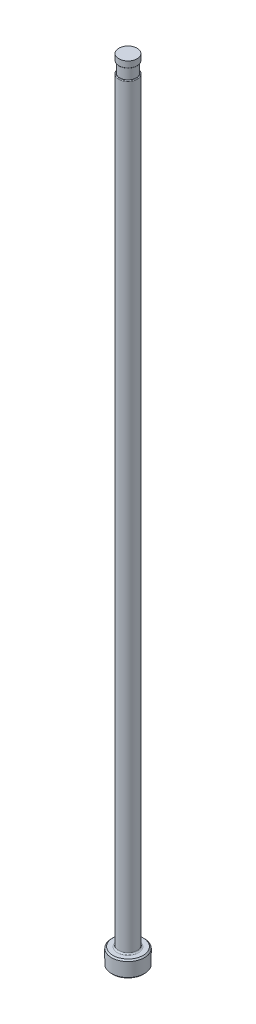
from build123d import *

# Parameters (mm, degrees)
CHAMFER1_SIZE     = 0.254
FILLET1_R         = 0.254
SKETCH2_W         = 0.2032
SKETCH2_H         = 2.032
D_SLOT_DEPTH      = 153.466131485
D_SLOT_DEPTH_BACK = 153.466131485
SKETCH5_W         = 0.01905
SKETCH5_H         = 1.27
FILLET2_R         = 0.127


with BuildPart() as part:
    # Sketch1 → Revolve1 (revolve)
    with BuildSketch(Plane.XY, mode=Mode.PRIVATE) as revolve1_sk:
        Polygon((0, 0), (-3.175, 0), (-3.175, 3.175), (-1.78562, 3.175), (-1.78562, 152.4), (0, 152.4), align=None)
    revolve(revolve1_sk.sketch.rotate(Axis((0, 259.958771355, 0), (0, -1, 0)), 270), axis=Axis((0, 259.958771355, 0), (0, -1, 0)))

    # Chamfer1
    chamfer1_edges = [part.edges().sort_by_distance(p)[0] for p in [
        (0, 3.175, -3.175),
        (0, 0, -3.175),
    ]]
    chamfer(chamfer1_edges, length=CHAMFER1_SIZE)

    # Fillet1
    fillet1_edges = [part.edges().sort_by_distance(p)[0] for p in [
        (0, 3.175, -1.78562),
    ]]
    fillet(fillet1_edges, radius=FILLET1_R)

    # Sketch2 → Vent Relief (revolve, cut)
    with BuildSketch(Plane.XY, mode=Mode.PRIVATE) as vent_relief_sk:
        with Locations((-1.68402, 150.114)):
            Rectangle(SKETCH2_W, SKETCH2_H)
    revolve(vent_relief_sk.sketch.rotate(Axis((0, 153.448281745, 0), (0, -1, 0)), 270), axis=Axis((0, 153.448281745, 0), (0, -1, 0)), mode=Mode.SUBTRACT)

    # Sketch3 → D-Slot (cut, two sides: drawn at the far end of the back side and taken through both)
    with BuildSketch(Plane.XY.offset(-D_SLOT_DEPTH_BACK)):
        with BuildLine():
            Line((-1.58242, 150.114), (-1.58242, 86.614))
            ThreePointArc((-1.58242, 86.614), (-1.633633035, 86.046038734), (-1.78562, 85.4964))
            Line((-1.78562, 85.4964), (-1.78562, 150.114))
            Line((-1.78562, 150.114), (-1.58242, 150.114))
        make_face()
    extrude(amount=D_SLOT_DEPTH + D_SLOT_DEPTH_BACK, mode=Mode.SUBTRACT)

    # Sketch5 → Vent Diameter (revolve, cut)
    with BuildSketch(Plane.XY, mode=Mode.PRIVATE) as vent_diameter_sk:
        with Locations((-1.776095, 151.765)):
            Rectangle(SKETCH5_W, SKETCH5_H)
    revolve(vent_diameter_sk.sketch.rotate(Axis((0, 152.687735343, 0), (0, -1, 0)), 90), axis=Axis((0, 152.687735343, 0), (0, -1, 0)), mode=Mode.SUBTRACT)

    # Fillet2
    fillet2_edges = [part.edges().sort_by_distance(p)[0] for p in [
        (1.527357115, 149.098, -0.924996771),
        (0, 151.13, 1.76657),
    ]]
    fillet(fillet2_edges, radius=FILLET2_R)


solid = part.part
